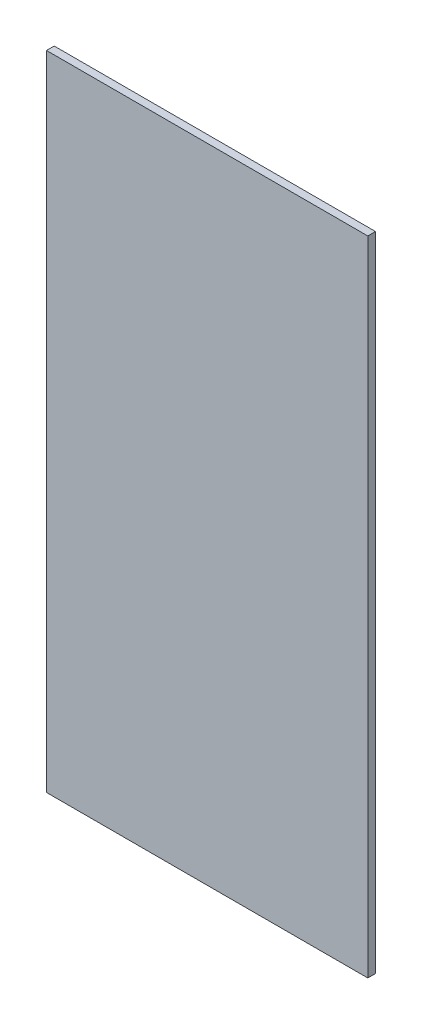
ISO-10303-21;
HEADER;
FILE_DESCRIPTION(('STEP AP214'),'2;1');
FILE_NAME('part.step','',(''),(''),'','','');
FILE_SCHEMA(('AUTOMOTIVE_DESIGN { 1 0 10303 214 1 1 1 1 }'));
ENDSEC;
DATA;
#1=APPLICATION_CONTEXT('core data for automotive mechanical design processes');
#2=APPLICATION_PROTOCOL_DEFINITION('international standard','automotive_design',2000,#1);
#3=PRODUCT_CONTEXT('',#1,'mechanical');
#4=PRODUCT('Part','Part','',(#3));
#5=PRODUCT_RELATED_PRODUCT_CATEGORY('part','',(#4));
#6=PRODUCT_DEFINITION_FORMATION('','',#4);
#7=PRODUCT_DEFINITION_CONTEXT('part definition',#1,'design');
#8=PRODUCT_DEFINITION('design','',#6,#7);
#9=PRODUCT_DEFINITION_SHAPE('','',#8);
#10=(LENGTH_UNIT() NAMED_UNIT(*) SI_UNIT(.MILLI.,.METRE.));
#11=(NAMED_UNIT(*) PLANE_ANGLE_UNIT() SI_UNIT($,.RADIAN.));
#12=(NAMED_UNIT(*) SI_UNIT($,.STERADIAN.) SOLID_ANGLE_UNIT());
#13=UNCERTAINTY_MEASURE_WITH_UNIT(LENGTH_MEASURE(1.E-05),#10,'distance_accuracy_value','');
#14=(GEOMETRIC_REPRESENTATION_CONTEXT(3) GLOBAL_UNCERTAINTY_ASSIGNED_CONTEXT((#13)) GLOBAL_UNIT_ASSIGNED_CONTEXT((#10,
#11,#12)) REPRESENTATION_CONTEXT('',''));
#15=CARTESIAN_POINT('',(0.,0.,0.));
#16=DIRECTION('',(0.,0.,1.));
#17=DIRECTION('',(1.,0.,0.));
#18=AXIS2_PLACEMENT_3D('',#15,#16,#17);
#19=CARTESIAN_POINT('',(0.,0.,6.));
#20=DIRECTION('',(1.,0.,0.));
#21=DIRECTION('',(0.,1.,0.));
#22=AXIS2_PLACEMENT_3D('',#19,#20,#21);
#23=PLANE('',#22);
#24=DIRECTION('',(0.,-1.,0.));
#25=VECTOR('',#24,1.);
#26=CARTESIAN_POINT('',(0.,0.,0.));
#27=LINE('',#26,#25);
#28=CARTESIAN_POINT('',(0.,0.,0.));
#29=VERTEX_POINT('',#28);
#30=CARTESIAN_POINT('',(0.,-500.,0.));
#31=VERTEX_POINT('',#30);
#32=EDGE_CURVE('E113',#29,#31,#27,.T.);
#33=ORIENTED_EDGE('',*,*,#32,.T.);
#34=DIRECTION('',(0.,0.,-1.));
#35=VECTOR('',#34,1.);
#36=CARTESIAN_POINT('',(0.,-500.,6.));
#37=LINE('',#36,#35);
#38=CARTESIAN_POINT('',(0.,-500.,6.));
#39=VERTEX_POINT('',#38);
#40=EDGE_CURVE('E11',#39,#31,#37,.T.);
#41=ORIENTED_EDGE('',*,*,#40,.F.);
#42=DIRECTION('',(0.,-1.,0.));
#43=VECTOR('',#42,1.);
#44=CARTESIAN_POINT('',(0.,0.,6.));
#45=LINE('',#44,#43);
#46=CARTESIAN_POINT('',(0.,0.,6.));
#47=VERTEX_POINT('',#46);
#48=EDGE_CURVE('E97',#47,#39,#45,.T.);
#49=ORIENTED_EDGE('',*,*,#48,.F.);
#50=DIRECTION('',(0.,0.,-1.));
#51=VECTOR('',#50,1.);
#52=CARTESIAN_POINT('',(0.,0.,6.));
#53=LINE('',#52,#51);
#54=EDGE_CURVE('E109',#47,#29,#53,.T.);
#55=ORIENTED_EDGE('',*,*,#54,.T.);
#56=EDGE_LOOP('',(#33,#41,#49,#55));
#57=FACE_BOUND('',#56,.T.);
#58=ADVANCED_FACE('F45',(#57),#23,.F.);
#59=CARTESIAN_POINT('',(0.,-500.,6.));
#60=DIRECTION('',(0.,1.,0.));
#61=DIRECTION('',(0.,0.,1.));
#62=AXIS2_PLACEMENT_3D('',#59,#60,#61);
#63=PLANE('',#62);
#64=DIRECTION('',(1.,0.,0.));
#65=VECTOR('',#64,1.);
#66=CARTESIAN_POINT('',(0.,-500.,0.));
#67=LINE('',#66,#65);
#68=CARTESIAN_POINT('',(250.,-500.,0.));
#69=VERTEX_POINT('',#68);
#70=EDGE_CURVE('E102',#31,#69,#67,.T.);
#71=ORIENTED_EDGE('',*,*,#70,.T.);
#72=DIRECTION('',(0.,0.,-1.));
#73=VECTOR('',#72,1.);
#74=CARTESIAN_POINT('',(250.,-500.,6.));
#75=LINE('',#74,#73);
#76=CARTESIAN_POINT('',(250.,-500.,6.));
#77=VERTEX_POINT('',#76);
#78=EDGE_CURVE('E54',#77,#69,#75,.T.);
#79=ORIENTED_EDGE('',*,*,#78,.F.);
#80=DIRECTION('',(1.,0.,0.));
#81=VECTOR('',#80,1.);
#82=CARTESIAN_POINT('',(0.,-500.,6.));
#83=LINE('',#82,#81);
#84=EDGE_CURVE('E92',#39,#77,#83,.T.);
#85=ORIENTED_EDGE('',*,*,#84,.F.);
#86=ORIENTED_EDGE('',*,*,#40,.T.);
#87=EDGE_LOOP('',(#71,#79,#85,#86));
#88=FACE_BOUND('',#87,.T.);
#89=ADVANCED_FACE('F101',(#88),#63,.F.);
#90=CARTESIAN_POINT('',(250.,0.,6.));
#91=DIRECTION('',(-1.,0.,0.));
#92=DIRECTION('',(0.,-1.,0.));
#93=AXIS2_PLACEMENT_3D('',#90,#91,#92);
#94=PLANE('',#93);
#95=DIRECTION('',(0.,1.,0.));
#96=VECTOR('',#95,1.);
#97=CARTESIAN_POINT('',(250.,0.,0.));
#98=LINE('',#97,#96);
#99=CARTESIAN_POINT('',(250.,0.,0.));
#100=VERTEX_POINT('',#99);
#101=EDGE_CURVE('E79',#69,#100,#98,.T.);
#102=ORIENTED_EDGE('',*,*,#101,.T.);
#103=DIRECTION('',(0.,0.,-1.));
#104=VECTOR('',#103,1.);
#105=CARTESIAN_POINT('',(250.,0.,6.));
#106=LINE('',#105,#104);
#107=CARTESIAN_POINT('',(250.,0.,6.));
#108=VERTEX_POINT('',#107);
#109=EDGE_CURVE('E104',#108,#100,#106,.T.);
#110=ORIENTED_EDGE('',*,*,#109,.F.);
#111=DIRECTION('',(0.,1.,0.));
#112=VECTOR('',#111,1.);
#113=CARTESIAN_POINT('',(250.,0.,6.));
#114=LINE('',#113,#112);
#115=EDGE_CURVE('E95',#77,#108,#114,.T.);
#116=ORIENTED_EDGE('',*,*,#115,.F.);
#117=ORIENTED_EDGE('',*,*,#78,.T.);
#118=EDGE_LOOP('',(#102,#110,#116,#117));
#119=FACE_BOUND('',#118,.T.);
#120=ADVANCED_FACE('F105',(#119),#94,.F.);
#121=CARTESIAN_POINT('',(0.,0.,6.));
#122=DIRECTION('',(0.,-1.,0.));
#123=DIRECTION('',(0.,0.,-1.));
#124=AXIS2_PLACEMENT_3D('',#121,#122,#123);
#125=PLANE('',#124);
#126=DIRECTION('',(-1.,0.,0.));
#127=VECTOR('',#126,1.);
#128=CARTESIAN_POINT('',(0.,0.,0.));
#129=LINE('',#128,#127);
#130=EDGE_CURVE('E85',#100,#29,#129,.T.);
#131=ORIENTED_EDGE('',*,*,#130,.T.);
#132=ORIENTED_EDGE('',*,*,#54,.F.);
#133=DIRECTION('',(-1.,0.,0.));
#134=VECTOR('',#133,1.);
#135=CARTESIAN_POINT('',(0.,0.,6.));
#136=LINE('',#135,#134);
#137=EDGE_CURVE('E62',#108,#47,#136,.T.);
#138=ORIENTED_EDGE('',*,*,#137,.F.);
#139=ORIENTED_EDGE('',*,*,#109,.T.);
#140=EDGE_LOOP('',(#131,#132,#138,#139));
#141=FACE_BOUND('',#140,.T.);
#142=ADVANCED_FACE('F126',(#141),#125,.F.);
#143=CARTESIAN_POINT('',(0.,0.,6.));
#144=DIRECTION('',(0.,0.,1.));
#145=DIRECTION('',(1.,0.,0.));
#146=AXIS2_PLACEMENT_3D('',#143,#144,#145);
#147=PLANE('',#146);
#148=ORIENTED_EDGE('',*,*,#48,.T.);
#149=ORIENTED_EDGE('',*,*,#84,.T.);
#150=ORIENTED_EDGE('',*,*,#115,.T.);
#151=ORIENTED_EDGE('',*,*,#137,.T.);
#152=EDGE_LOOP('',(#148,#149,#150,#151));
#153=FACE_BOUND('',#152,.T.);
#154=ADVANCED_FACE('F93',(#153),#147,.T.);
#155=CARTESIAN_POINT('',(0.,0.,0.));
#156=DIRECTION('',(0.,0.,1.));
#157=DIRECTION('',(1.,0.,0.));
#158=AXIS2_PLACEMENT_3D('',#155,#156,#157);
#159=PLANE('',#158);
#160=ORIENTED_EDGE('',*,*,#32,.F.);
#161=ORIENTED_EDGE('',*,*,#130,.F.);
#162=ORIENTED_EDGE('',*,*,#101,.F.);
#163=ORIENTED_EDGE('',*,*,#70,.F.);
#164=EDGE_LOOP('',(#160,#161,#162,#163));
#165=FACE_BOUND('',#164,.T.);
#166=ADVANCED_FACE('F129',(#165),#159,.F.);
#167=CLOSED_SHELL('',(#58,#89,#120,#142,#154,#166));
#168=MANIFOLD_SOLID_BREP('B2',#167);
#169=ADVANCED_BREP_SHAPE_REPRESENTATION('',(#18,#168),#14);
#170=SHAPE_DEFINITION_REPRESENTATION(#9,#169);
ENDSEC;
END-ISO-10303-21;
